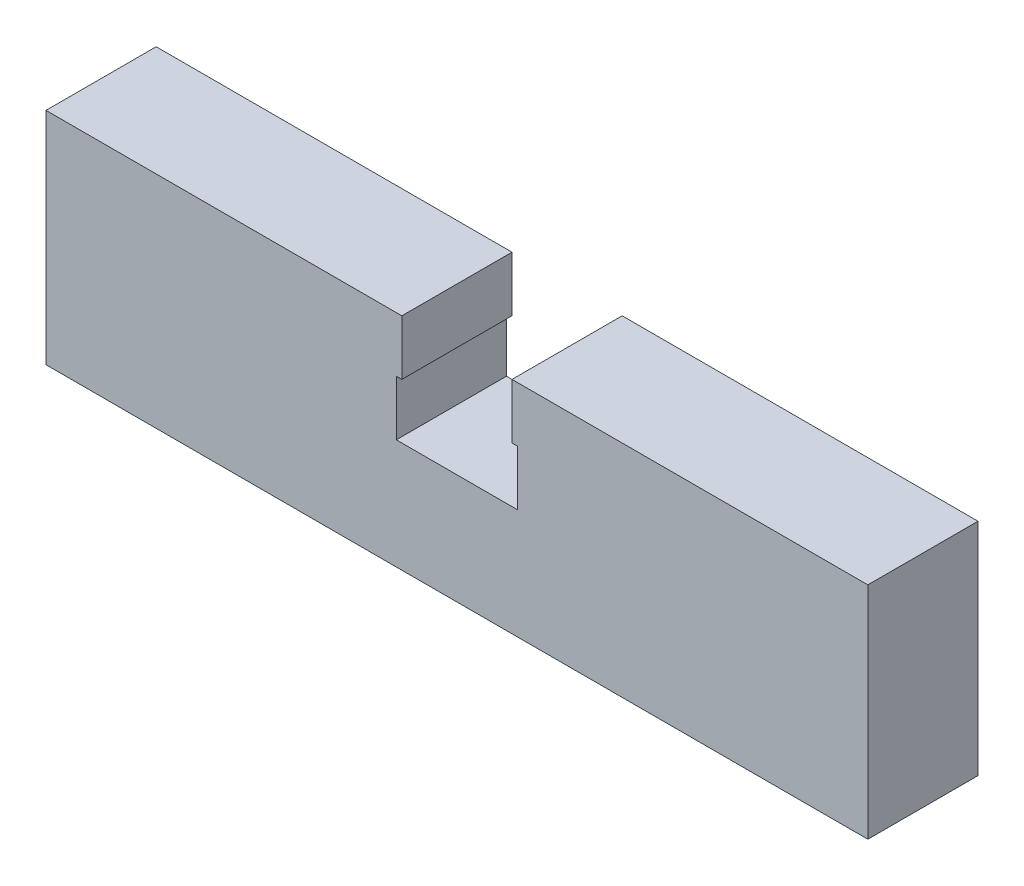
ISO-10303-21;
HEADER;
FILE_DESCRIPTION(('STEP AP214'),'2;1');
FILE_NAME('part.step','',(''),(''),'','','');
FILE_SCHEMA(('AUTOMOTIVE_DESIGN { 1 0 10303 214 1 1 1 1 }'));
ENDSEC;
DATA;
#1=APPLICATION_CONTEXT('core data for automotive mechanical design processes');
#2=APPLICATION_PROTOCOL_DEFINITION('international standard','automotive_design',2000,#1);
#3=PRODUCT_CONTEXT('',#1,'mechanical');
#4=PRODUCT('Part','Part','',(#3));
#5=PRODUCT_RELATED_PRODUCT_CATEGORY('part','',(#4));
#6=PRODUCT_DEFINITION_FORMATION('','',#4);
#7=PRODUCT_DEFINITION_CONTEXT('part definition',#1,'design');
#8=PRODUCT_DEFINITION('design','',#6,#7);
#9=PRODUCT_DEFINITION_SHAPE('','',#8);
#10=(LENGTH_UNIT() NAMED_UNIT(*) SI_UNIT(.MILLI.,.METRE.));
#11=(NAMED_UNIT(*) PLANE_ANGLE_UNIT() SI_UNIT($,.RADIAN.));
#12=(NAMED_UNIT(*) SI_UNIT($,.STERADIAN.) SOLID_ANGLE_UNIT());
#13=UNCERTAINTY_MEASURE_WITH_UNIT(LENGTH_MEASURE(1.E-05),#10,'distance_accuracy_value','');
#14=(GEOMETRIC_REPRESENTATION_CONTEXT(3) GLOBAL_UNCERTAINTY_ASSIGNED_CONTEXT((#13)) GLOBAL_UNIT_ASSIGNED_CONTEXT((#10,
#11,#12)) REPRESENTATION_CONTEXT('',''));
#15=CARTESIAN_POINT('',(0.,0.,0.));
#16=DIRECTION('',(0.,0.,1.));
#17=DIRECTION('',(1.,0.,0.));
#18=AXIS2_PLACEMENT_3D('',#15,#16,#17);
#19=CARTESIAN_POINT('',(47.371,-12.7,12.7));
#20=DIRECTION('',(-1.,0.,0.));
#21=DIRECTION('',(0.,0.,1.));
#22=AXIS2_PLACEMENT_3D('',#19,#20,#21);
#23=PLANE('',#22);
#24=DIRECTION('',(0.,1.,0.));
#25=VECTOR('',#24,1.);
#26=CARTESIAN_POINT('',(47.371,-12.7,0.));
#27=LINE('',#26,#25);
#28=CARTESIAN_POINT('',(47.371,-12.7,0.));
#29=VERTEX_POINT('',#28);
#30=CARTESIAN_POINT('',(47.371,12.7,0.));
#31=VERTEX_POINT('',#30);
#32=EDGE_CURVE('E183',#29,#31,#27,.T.);
#33=ORIENTED_EDGE('',*,*,#32,.T.);
#34=DIRECTION('',(0.,0.,-1.));
#35=VECTOR('',#34,1.);
#36=CARTESIAN_POINT('',(47.371,12.7,12.7));
#37=LINE('',#36,#35);
#38=CARTESIAN_POINT('',(47.371,12.7,12.7));
#39=VERTEX_POINT('',#38);
#40=EDGE_CURVE('E11',#39,#31,#37,.T.);
#41=ORIENTED_EDGE('',*,*,#40,.F.);
#42=DIRECTION('',(0.,1.,0.));
#43=VECTOR('',#42,1.);
#44=CARTESIAN_POINT('',(47.371,-12.7,12.7));
#45=LINE('',#44,#43);
#46=CARTESIAN_POINT('',(47.371,-12.7,12.7));
#47=VERTEX_POINT('',#46);
#48=EDGE_CURVE('E155',#47,#39,#45,.T.);
#49=ORIENTED_EDGE('',*,*,#48,.F.);
#50=DIRECTION('',(0.,0.,-1.));
#51=VECTOR('',#50,1.);
#52=CARTESIAN_POINT('',(47.371,-12.7,12.7));
#53=LINE('',#52,#51);
#54=EDGE_CURVE('E156',#47,#29,#53,.T.);
#55=ORIENTED_EDGE('',*,*,#54,.T.);
#56=EDGE_LOOP('',(#33,#41,#49,#55));
#57=FACE_BOUND('',#56,.T.);
#58=ADVANCED_FACE('F35',(#57),#23,.F.);
#59=CARTESIAN_POINT('',(6.35,12.7,12.7));
#60=DIRECTION('',(0.,-1.,0.));
#61=DIRECTION('',(0.,0.,-1.));
#62=AXIS2_PLACEMENT_3D('',#59,#60,#61);
#63=PLANE('',#62);
#64=DIRECTION('',(-1.,0.,0.));
#65=VECTOR('',#64,1.);
#66=CARTESIAN_POINT('',(6.35,12.7,0.));
#67=LINE('',#66,#65);
#68=CARTESIAN_POINT('',(6.35,12.7,0.));
#69=VERTEX_POINT('',#68);
#70=EDGE_CURVE('E180',#31,#69,#67,.T.);
#71=ORIENTED_EDGE('',*,*,#70,.T.);
#72=DIRECTION('',(0.,0.,-1.));
#73=VECTOR('',#72,1.);
#74=CARTESIAN_POINT('',(6.35,12.7,12.7));
#75=LINE('',#74,#73);
#76=CARTESIAN_POINT('',(6.35,12.7,12.7));
#77=VERTEX_POINT('',#76);
#78=EDGE_CURVE('E42',#77,#69,#75,.T.);
#79=ORIENTED_EDGE('',*,*,#78,.F.);
#80=DIRECTION('',(-1.,0.,0.));
#81=VECTOR('',#80,1.);
#82=CARTESIAN_POINT('',(6.35,12.7,12.7));
#83=LINE('',#82,#81);
#84=EDGE_CURVE('E198',#39,#77,#83,.T.);
#85=ORIENTED_EDGE('',*,*,#84,.F.);
#86=ORIENTED_EDGE('',*,*,#40,.T.);
#87=EDGE_LOOP('',(#71,#79,#85,#86));
#88=FACE_BOUND('',#87,.T.);
#89=ADVANCED_FACE('F248',(#88),#63,.F.);
#90=CARTESIAN_POINT('',(6.35,12.7,12.7));
#91=DIRECTION('',(1.,0.,0.));
#92=DIRECTION('',(0.,1.,0.));
#93=AXIS2_PLACEMENT_3D('',#90,#91,#92);
#94=PLANE('',#93);
#95=DIRECTION('',(0.,-1.,0.));
#96=VECTOR('',#95,1.);
#97=CARTESIAN_POINT('',(6.35,12.7,0.));
#98=LINE('',#97,#96);
#99=CARTESIAN_POINT('',(6.35,6.35,0.));
#100=VERTEX_POINT('',#99);
#101=EDGE_CURVE('E148',#69,#100,#98,.T.);
#102=ORIENTED_EDGE('',*,*,#101,.T.);
#103=DIRECTION('',(0.,0.,1.));
#104=VECTOR('',#103,1.);
#105=CARTESIAN_POINT('',(6.35,6.35,0.));
#106=LINE('',#105,#104);
#107=CARTESIAN_POINT('',(6.35,6.35,12.7));
#108=VERTEX_POINT('',#107);
#109=EDGE_CURVE('E207',#100,#108,#106,.T.);
#110=ORIENTED_EDGE('',*,*,#109,.T.);
#111=DIRECTION('',(0.,-1.,0.));
#112=VECTOR('',#111,1.);
#113=CARTESIAN_POINT('',(6.35,12.7,12.7));
#114=LINE('',#113,#112);
#115=EDGE_CURVE('E176',#77,#108,#114,.T.);
#116=ORIENTED_EDGE('',*,*,#115,.F.);
#117=ORIENTED_EDGE('',*,*,#78,.T.);
#118=EDGE_LOOP('',(#102,#110,#116,#117));
#119=FACE_BOUND('',#118,.T.);
#120=ADVANCED_FACE('F173',(#119),#94,.F.);
#121=CARTESIAN_POINT('',(-6.35,0.,12.7));
#122=DIRECTION('',(0.,-1.,0.));
#123=DIRECTION('',(1.,0.,0.));
#124=AXIS2_PLACEMENT_3D('',#121,#122,#123);
#125=PLANE('',#124);
#126=DIRECTION('',(-1.,0.,0.));
#127=VECTOR('',#126,1.);
#128=CARTESIAN_POINT('',(-6.35,0.,0.));
#129=LINE('',#128,#127);
#130=CARTESIAN_POINT('',(6.985,0.,0.));
#131=VERTEX_POINT('',#130);
#132=CARTESIAN_POINT('',(-6.985,0.,0.));
#133=VERTEX_POINT('',#132);
#134=EDGE_CURVE('E56',#131,#133,#129,.T.);
#135=ORIENTED_EDGE('',*,*,#134,.T.);
#136=DIRECTION('',(0.,0.,1.));
#137=VECTOR('',#136,1.);
#138=CARTESIAN_POINT('',(-6.985,0.,0.));
#139=LINE('',#138,#137);
#140=CARTESIAN_POINT('',(-6.985,0.,12.7));
#141=VERTEX_POINT('',#140);
#142=EDGE_CURVE('E188',#133,#141,#139,.T.);
#143=ORIENTED_EDGE('',*,*,#142,.T.);
#144=DIRECTION('',(-1.,0.,0.));
#145=VECTOR('',#144,1.);
#146=CARTESIAN_POINT('',(-6.35,0.,12.7));
#147=LINE('',#146,#145);
#148=CARTESIAN_POINT('',(6.985,0.,12.7));
#149=VERTEX_POINT('',#148);
#150=EDGE_CURVE('E195',#149,#141,#147,.T.);
#151=ORIENTED_EDGE('',*,*,#150,.F.);
#152=DIRECTION('',(0.,0.,1.));
#153=VECTOR('',#152,1.);
#154=CARTESIAN_POINT('',(6.985,0.,0.));
#155=LINE('',#154,#153);
#156=EDGE_CURVE('E202',#131,#149,#155,.T.);
#157=ORIENTED_EDGE('',*,*,#156,.F.);
#158=EDGE_LOOP('',(#135,#143,#151,#157));
#159=FACE_BOUND('',#158,.T.);
#160=ADVANCED_FACE('F230',(#159),#125,.F.);
#161=CARTESIAN_POINT('',(-6.35,12.7,12.7));
#162=DIRECTION('',(-1.,0.,0.));
#163=DIRECTION('',(0.,-1.,0.));
#164=AXIS2_PLACEMENT_3D('',#161,#162,#163);
#165=PLANE('',#164);
#166=DIRECTION('',(0.,1.,0.));
#167=VECTOR('',#166,1.);
#168=CARTESIAN_POINT('',(-6.35,12.7,12.7));
#169=LINE('',#168,#167);
#170=CARTESIAN_POINT('',(-6.35,6.35,12.7));
#171=VERTEX_POINT('',#170);
#172=CARTESIAN_POINT('',(-6.35,12.7,12.7));
#173=VERTEX_POINT('',#172);
#174=EDGE_CURVE('E139',#171,#173,#169,.T.);
#175=ORIENTED_EDGE('',*,*,#174,.F.);
#176=DIRECTION('',(0.,0.,1.));
#177=VECTOR('',#176,1.);
#178=CARTESIAN_POINT('',(-6.35,6.35,0.));
#179=LINE('',#178,#177);
#180=CARTESIAN_POINT('',(-6.35,6.35,0.));
#181=VERTEX_POINT('',#180);
#182=EDGE_CURVE('E127',#181,#171,#179,.T.);
#183=ORIENTED_EDGE('',*,*,#182,.F.);
#184=DIRECTION('',(0.,1.,0.));
#185=VECTOR('',#184,1.);
#186=CARTESIAN_POINT('',(-6.35,12.7,0.));
#187=LINE('',#186,#185);
#188=CARTESIAN_POINT('',(-6.35,12.7,0.));
#189=VERTEX_POINT('',#188);
#190=EDGE_CURVE('E137',#181,#189,#187,.T.);
#191=ORIENTED_EDGE('',*,*,#190,.T.);
#192=DIRECTION('',(0.,0.,-1.));
#193=VECTOR('',#192,1.);
#194=CARTESIAN_POINT('',(-6.35,12.7,12.7));
#195=LINE('',#194,#193);
#196=EDGE_CURVE('E166',#173,#189,#195,.T.);
#197=ORIENTED_EDGE('',*,*,#196,.F.);
#198=EDGE_LOOP('',(#175,#183,#191,#197));
#199=FACE_BOUND('',#198,.T.);
#200=ADVANCED_FACE('F135',(#199),#165,.F.);
#201=CARTESIAN_POINT('',(-47.371,12.7,12.7));
#202=DIRECTION('',(0.,-1.,0.));
#203=DIRECTION('',(0.,0.,-1.));
#204=AXIS2_PLACEMENT_3D('',#201,#202,#203);
#205=PLANE('',#204);
#206=DIRECTION('',(-1.,0.,0.));
#207=VECTOR('',#206,1.);
#208=CARTESIAN_POINT('',(-47.371,12.7,0.));
#209=LINE('',#208,#207);
#210=CARTESIAN_POINT('',(-47.371,12.7,0.));
#211=VERTEX_POINT('',#210);
#212=EDGE_CURVE('E144',#189,#211,#209,.T.);
#213=ORIENTED_EDGE('',*,*,#212,.T.);
#214=DIRECTION('',(0.,0.,-1.));
#215=VECTOR('',#214,1.);
#216=CARTESIAN_POINT('',(-47.371,12.7,12.7));
#217=LINE('',#216,#215);
#218=CARTESIAN_POINT('',(-47.371,12.7,12.7));
#219=VERTEX_POINT('',#218);
#220=EDGE_CURVE('E163',#219,#211,#217,.T.);
#221=ORIENTED_EDGE('',*,*,#220,.F.);
#222=DIRECTION('',(-1.,0.,0.));
#223=VECTOR('',#222,1.);
#224=CARTESIAN_POINT('',(-47.371,12.7,12.7));
#225=LINE('',#224,#223);
#226=EDGE_CURVE('E192',#173,#219,#225,.T.);
#227=ORIENTED_EDGE('',*,*,#226,.F.);
#228=ORIENTED_EDGE('',*,*,#196,.T.);
#229=EDGE_LOOP('',(#213,#221,#227,#228));
#230=FACE_BOUND('',#229,.T.);
#231=ADVANCED_FACE('F267',(#230),#205,.F.);
#232=CARTESIAN_POINT('',(-47.371,-12.7,12.7));
#233=DIRECTION('',(1.,0.,0.));
#234=DIRECTION('',(0.,0.,-1.));
#235=AXIS2_PLACEMENT_3D('',#232,#233,#234);
#236=PLANE('',#235);
#237=DIRECTION('',(0.,-1.,0.));
#238=VECTOR('',#237,1.);
#239=CARTESIAN_POINT('',(-47.371,-12.7,0.));
#240=LINE('',#239,#238);
#241=CARTESIAN_POINT('',(-47.371,-12.7,0.));
#242=VERTEX_POINT('',#241);
#243=EDGE_CURVE('E146',#211,#242,#240,.T.);
#244=ORIENTED_EDGE('',*,*,#243,.T.);
#245=DIRECTION('',(0.,0.,-1.));
#246=VECTOR('',#245,1.);
#247=CARTESIAN_POINT('',(-47.371,-12.7,12.7));
#248=LINE('',#247,#246);
#249=CARTESIAN_POINT('',(-47.371,-12.7,12.7));
#250=VERTEX_POINT('',#249);
#251=EDGE_CURVE('E159',#250,#242,#248,.T.);
#252=ORIENTED_EDGE('',*,*,#251,.F.);
#253=DIRECTION('',(0.,-1.,0.));
#254=VECTOR('',#253,1.);
#255=CARTESIAN_POINT('',(-47.371,-12.7,12.7));
#256=LINE('',#255,#254);
#257=EDGE_CURVE('E190',#219,#250,#256,.T.);
#258=ORIENTED_EDGE('',*,*,#257,.F.);
#259=ORIENTED_EDGE('',*,*,#220,.T.);
#260=EDGE_LOOP('',(#244,#252,#258,#259));
#261=FACE_BOUND('',#260,.T.);
#262=ADVANCED_FACE('F263',(#261),#236,.F.);
#263=CARTESIAN_POINT('',(-47.371,-12.7,12.7));
#264=DIRECTION('',(0.,1.,0.));
#265=DIRECTION('',(0.,0.,1.));
#266=AXIS2_PLACEMENT_3D('',#263,#264,#265);
#267=PLANE('',#266);
#268=DIRECTION('',(1.,0.,0.));
#269=VECTOR('',#268,1.);
#270=CARTESIAN_POINT('',(-47.371,-12.7,0.));
#271=LINE('',#270,#269);
#272=EDGE_CURVE('E153',#242,#29,#271,.T.);
#273=ORIENTED_EDGE('',*,*,#272,.T.);
#274=ORIENTED_EDGE('',*,*,#54,.F.);
#275=DIRECTION('',(1.,0.,0.));
#276=VECTOR('',#275,1.);
#277=CARTESIAN_POINT('',(-47.371,-12.7,12.7));
#278=LINE('',#277,#276);
#279=EDGE_CURVE('E160',#250,#47,#278,.T.);
#280=ORIENTED_EDGE('',*,*,#279,.F.);
#281=ORIENTED_EDGE('',*,*,#251,.T.);
#282=EDGE_LOOP('',(#273,#274,#280,#281));
#283=FACE_BOUND('',#282,.T.);
#284=ADVANCED_FACE('F258',(#283),#267,.F.);
#285=CARTESIAN_POINT('',(0.,0.,12.7));
#286=DIRECTION('',(0.,0.,-1.));
#287=DIRECTION('',(-1.,0.,0.));
#288=AXIS2_PLACEMENT_3D('',#285,#286,#287);
#289=PLANE('',#288);
#290=ORIENTED_EDGE('',*,*,#150,.T.);
#291=DIRECTION('',(0.,-1.,0.));
#292=VECTOR('',#291,1.);
#293=CARTESIAN_POINT('',(-6.985,6.35,12.7));
#294=LINE('',#293,#292);
#295=CARTESIAN_POINT('',(-6.985,6.35,12.7));
#296=VERTEX_POINT('',#295);
#297=EDGE_CURVE('E131',#296,#141,#294,.T.);
#298=ORIENTED_EDGE('',*,*,#297,.F.);
#299=DIRECTION('',(-1.,0.,0.));
#300=VECTOR('',#299,1.);
#301=CARTESIAN_POINT('',(-6.35,6.35,12.7));
#302=LINE('',#301,#300);
#303=EDGE_CURVE('E209',#171,#296,#302,.T.);
#304=ORIENTED_EDGE('',*,*,#303,.F.);
#305=ORIENTED_EDGE('',*,*,#174,.T.);
#306=ORIENTED_EDGE('',*,*,#226,.T.);
#307=ORIENTED_EDGE('',*,*,#257,.T.);
#308=ORIENTED_EDGE('',*,*,#279,.T.);
#309=ORIENTED_EDGE('',*,*,#48,.T.);
#310=ORIENTED_EDGE('',*,*,#84,.T.);
#311=ORIENTED_EDGE('',*,*,#115,.T.);
#312=DIRECTION('',(-1.,0.,0.));
#313=VECTOR('',#312,1.);
#314=CARTESIAN_POINT('',(6.35,6.35,12.7));
#315=LINE('',#314,#313);
#316=CARTESIAN_POINT('',(6.985,6.35,12.7));
#317=VERTEX_POINT('',#316);
#318=EDGE_CURVE('E210',#317,#108,#315,.T.);
#319=ORIENTED_EDGE('',*,*,#318,.F.);
#320=DIRECTION('',(0.,1.,0.));
#321=VECTOR('',#320,1.);
#322=CARTESIAN_POINT('',(6.985,0.,12.7));
#323=LINE('',#322,#321);
#324=EDGE_CURVE('E213',#149,#317,#323,.T.);
#325=ORIENTED_EDGE('',*,*,#324,.F.);
#326=EDGE_LOOP('',(#290,#298,#304,#305,#306,#307,#308,#309,#310,#311,#319,#325));
#327=FACE_BOUND('',#326,.T.);
#328=ADVANCED_FACE('F226',(#327),#289,.F.);
#329=CARTESIAN_POINT('',(0.,0.,0.));
#330=DIRECTION('',(0.,0.,-1.));
#331=DIRECTION('',(-1.,0.,0.));
#332=AXIS2_PLACEMENT_3D('',#329,#330,#331);
#333=PLANE('',#332);
#334=DIRECTION('',(0.,-1.,0.));
#335=VECTOR('',#334,1.);
#336=CARTESIAN_POINT('',(-6.985,6.35,0.));
#337=LINE('',#336,#335);
#338=CARTESIAN_POINT('',(-6.985,6.35,0.));
#339=VERTEX_POINT('',#338);
#340=EDGE_CURVE('E49',#339,#133,#337,.T.);
#341=ORIENTED_EDGE('',*,*,#340,.T.);
#342=ORIENTED_EDGE('',*,*,#134,.F.);
#343=DIRECTION('',(0.,1.,0.));
#344=VECTOR('',#343,1.);
#345=CARTESIAN_POINT('',(6.985,0.,0.));
#346=LINE('',#345,#344);
#347=CARTESIAN_POINT('',(6.985,6.35,0.));
#348=VERTEX_POINT('',#347);
#349=EDGE_CURVE('E212',#131,#348,#346,.T.);
#350=ORIENTED_EDGE('',*,*,#349,.T.);
#351=DIRECTION('',(-1.,0.,0.));
#352=VECTOR('',#351,1.);
#353=CARTESIAN_POINT('',(6.35,6.35,0.));
#354=LINE('',#353,#352);
#355=EDGE_CURVE('E182',#348,#100,#354,.T.);
#356=ORIENTED_EDGE('',*,*,#355,.T.);
#357=ORIENTED_EDGE('',*,*,#101,.F.);
#358=ORIENTED_EDGE('',*,*,#70,.F.);
#359=ORIENTED_EDGE('',*,*,#32,.F.);
#360=ORIENTED_EDGE('',*,*,#272,.F.);
#361=ORIENTED_EDGE('',*,*,#243,.F.);
#362=ORIENTED_EDGE('',*,*,#212,.F.);
#363=ORIENTED_EDGE('',*,*,#190,.F.);
#364=DIRECTION('',(-1.,0.,0.));
#365=VECTOR('',#364,1.);
#366=CARTESIAN_POINT('',(-6.35,6.35,0.));
#367=LINE('',#366,#365);
#368=EDGE_CURVE('E123',#181,#339,#367,.T.);
#369=ORIENTED_EDGE('',*,*,#368,.T.);
#370=EDGE_LOOP('',(#341,#342,#350,#356,#357,#358,#359,#360,#361,#362,#363,#369));
#371=FACE_BOUND('',#370,.T.);
#372=ADVANCED_FACE('F142',(#371),#333,.T.);
#373=CARTESIAN_POINT('',(6.35,6.35,0.));
#374=DIRECTION('',(0.,1.,0.));
#375=DIRECTION('',(0.,0.,1.));
#376=AXIS2_PLACEMENT_3D('',#373,#374,#375);
#377=PLANE('',#376);
#378=ORIENTED_EDGE('',*,*,#318,.T.);
#379=ORIENTED_EDGE('',*,*,#109,.F.);
#380=ORIENTED_EDGE('',*,*,#355,.F.);
#381=DIRECTION('',(0.,0.,1.));
#382=VECTOR('',#381,1.);
#383=CARTESIAN_POINT('',(6.985,6.35,0.));
#384=LINE('',#383,#382);
#385=EDGE_CURVE('E205',#348,#317,#384,.T.);
#386=ORIENTED_EDGE('',*,*,#385,.T.);
#387=EDGE_LOOP('',(#378,#379,#380,#386));
#388=FACE_BOUND('',#387,.T.);
#389=ADVANCED_FACE('F236',(#388),#377,.F.);
#390=CARTESIAN_POINT('',(6.985,0.,0.));
#391=DIRECTION('',(1.,0.,0.));
#392=DIRECTION('',(0.,0.,-1.));
#393=AXIS2_PLACEMENT_3D('',#390,#391,#392);
#394=PLANE('',#393);
#395=ORIENTED_EDGE('',*,*,#324,.T.);
#396=ORIENTED_EDGE('',*,*,#385,.F.);
#397=ORIENTED_EDGE('',*,*,#349,.F.);
#398=ORIENTED_EDGE('',*,*,#156,.T.);
#399=EDGE_LOOP('',(#395,#396,#397,#398));
#400=FACE_BOUND('',#399,.T.);
#401=ADVANCED_FACE('F233',(#400),#394,.F.);
#402=CARTESIAN_POINT('',(-6.985,6.35,0.));
#403=DIRECTION('',(-1.,0.,0.));
#404=DIRECTION('',(0.,-1.,0.));
#405=AXIS2_PLACEMENT_3D('',#402,#403,#404);
#406=PLANE('',#405);
#407=ORIENTED_EDGE('',*,*,#297,.T.);
#408=ORIENTED_EDGE('',*,*,#142,.F.);
#409=ORIENTED_EDGE('',*,*,#340,.F.);
#410=DIRECTION('',(0.,0.,1.));
#411=VECTOR('',#410,1.);
#412=CARTESIAN_POINT('',(-6.985,6.35,0.));
#413=LINE('',#412,#411);
#414=EDGE_CURVE('E129',#339,#296,#413,.T.);
#415=ORIENTED_EDGE('',*,*,#414,.T.);
#416=EDGE_LOOP('',(#407,#408,#409,#415));
#417=FACE_BOUND('',#416,.T.);
#418=ADVANCED_FACE('F228',(#417),#406,.F.);
#419=CARTESIAN_POINT('',(-6.35,6.35,0.));
#420=DIRECTION('',(0.,1.,0.));
#421=DIRECTION('',(0.,0.,1.));
#422=AXIS2_PLACEMENT_3D('',#419,#420,#421);
#423=PLANE('',#422);
#424=ORIENTED_EDGE('',*,*,#303,.T.);
#425=ORIENTED_EDGE('',*,*,#414,.F.);
#426=ORIENTED_EDGE('',*,*,#368,.F.);
#427=ORIENTED_EDGE('',*,*,#182,.T.);
#428=EDGE_LOOP('',(#424,#425,#426,#427));
#429=FACE_BOUND('',#428,.T.);
#430=ADVANCED_FACE('F126',(#429),#423,.F.);
#431=CLOSED_SHELL('',(#58,#89,#120,#160,#200,#231,#262,#284,#328,#372,#389,#401,#418,#430));
#432=MANIFOLD_SOLID_BREP('B2',#431);
#433=ADVANCED_BREP_SHAPE_REPRESENTATION('',(#18,#432),#14);
#434=SHAPE_DEFINITION_REPRESENTATION(#9,#433);
ENDSEC;
END-ISO-10303-21;
